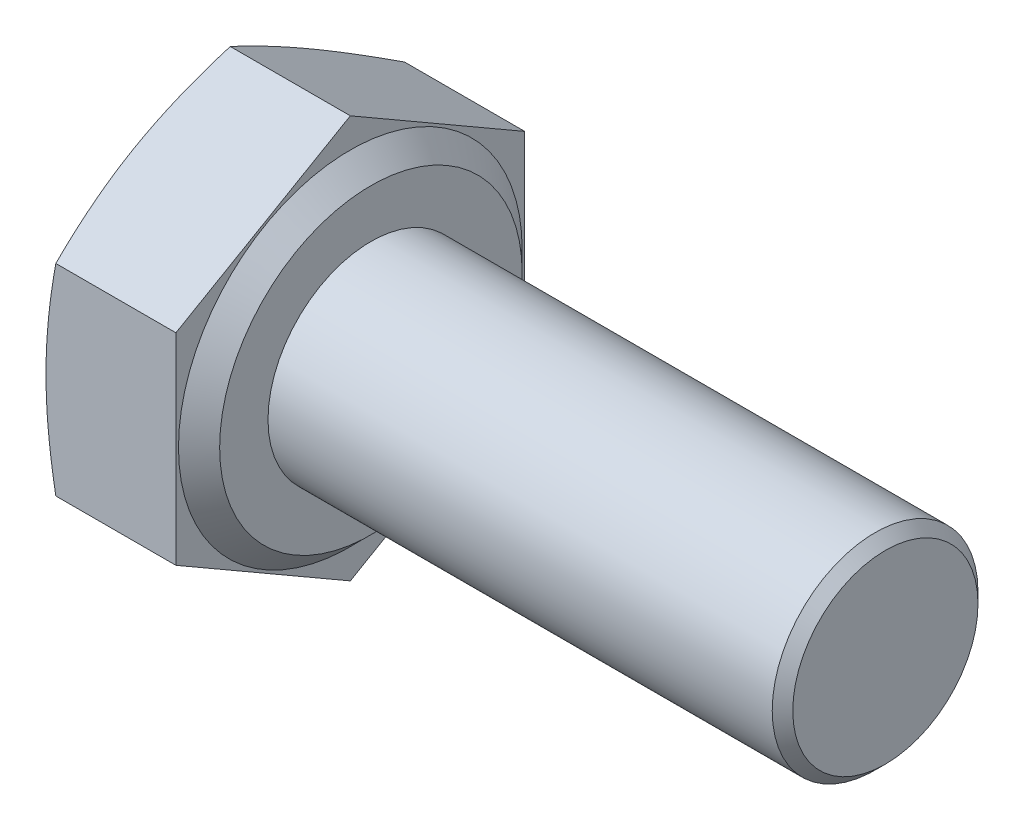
from build123d import *

# Parameters (mm, degrees)
BASEHEAD_DEPTH = 2.925
SKETCH5_R      = 2
BASEBODY_DEPTH = 10
CHAMFER1_SIZE  = 0.2


with BuildPart() as part:
    # Sketch2 → BaseHead (new body)
    with BuildSketch(Plane(origin=(0, 0, 0), x_dir=(0, 0, -1), z_dir=(1, 0, 0))):
        Polygon((3.39, -1.957217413), (3.39, 1.957217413), (0, 3.914434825), (-3.39, 1.957217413), (-3.39, -1.957217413), (0, -3.914434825), align=None)
    extrude(amount=BASEHEAD_DEPTH)

    # Sketch3 → BearingFace (revolve, cut)
    with BuildSketch(Plane.XY, mode=Mode.PRIVATE) as bearingface_sk:
        Polygon((2.925, 3.914434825), (2.925, 2.94), (2.525, 3.34), (2.525, 3.914434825), align=None)
    revolve(bearingface_sk.sketch.rotate(Axis((-0.957090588, 0, 0), (1, 0, 0)), 90), axis=Axis((-0.957090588, 0, 0), (1, 0, 0)), mode=Mode.SUBTRACT)

    # Sketch4 → HeadChamfer (revolve, cut)
    with BuildSketch(Plane.XY):
        Polygon((0, 3.914434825), (0.190878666, 3.914434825), (0, 3.39), align=None)
    revolve(axis=Axis((-0.493528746, 0, 0), (1, 0, 0)), mode=Mode.SUBTRACT)

    # Sketch5 → BaseBody (add)
    with BuildSketch(Plane(origin=(2.925, 0, 0), x_dir=(0, 0, -1), z_dir=(1, 0, 0))):
        Circle(SKETCH5_R)
    extrude(amount=BASEBODY_DEPTH)

    # Chamfer1
    chamfer1_edges = [part.edges().sort_by_distance(p)[0] for p in [
        (12.925, 0, 2),
    ]]
    chamfer(chamfer1_edges, length=CHAMFER1_SIZE)


solid = part.part
